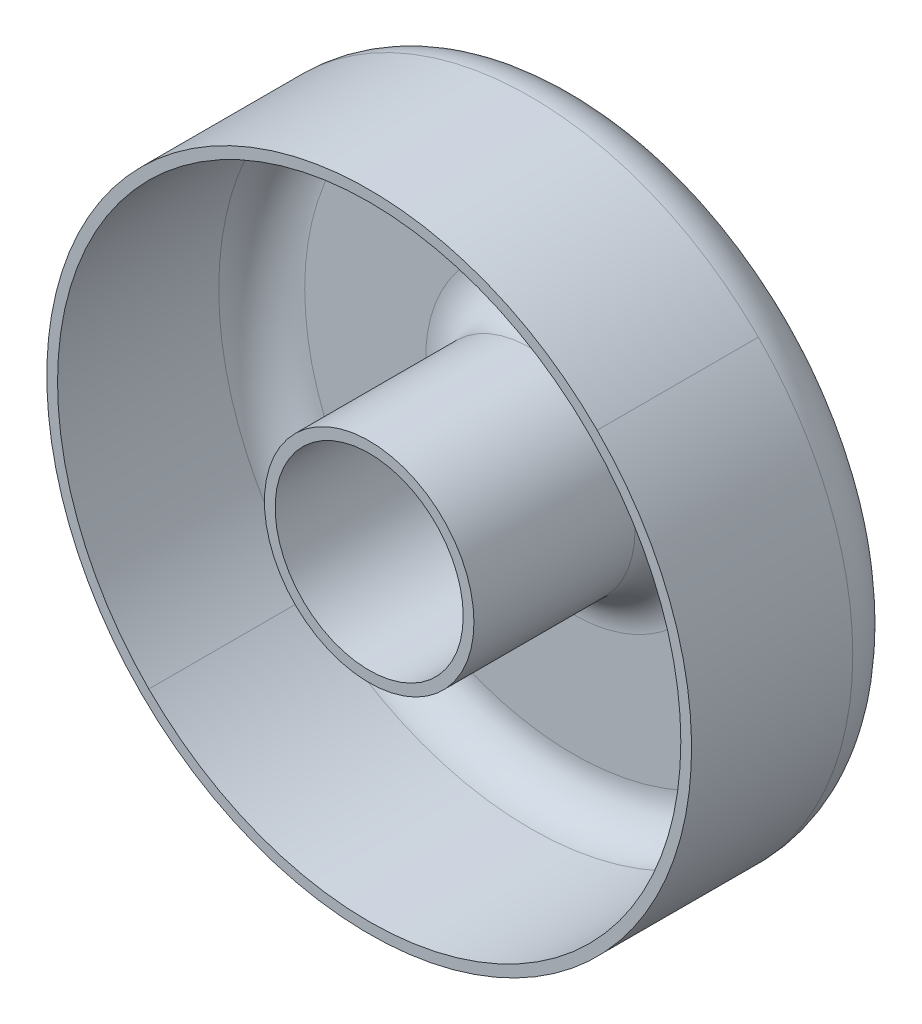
ISO-10303-21;
HEADER;
FILE_DESCRIPTION(('STEP AP214'),'2;1');
FILE_NAME('part.step','',(''),(''),'','','');
FILE_SCHEMA(('AUTOMOTIVE_DESIGN { 1 0 10303 214 1 1 1 1 }'));
ENDSEC;
DATA;
#1=APPLICATION_CONTEXT('core data for automotive mechanical design processes');
#2=APPLICATION_PROTOCOL_DEFINITION('international standard','automotive_design',2000,#1);
#3=PRODUCT_CONTEXT('',#1,'mechanical');
#4=PRODUCT('Part','Part','',(#3));
#5=PRODUCT_RELATED_PRODUCT_CATEGORY('part','',(#4));
#6=PRODUCT_DEFINITION_FORMATION('','',#4);
#7=PRODUCT_DEFINITION_CONTEXT('part definition',#1,'design');
#8=PRODUCT_DEFINITION('design','',#6,#7);
#9=PRODUCT_DEFINITION_SHAPE('','',#8);
#10=(LENGTH_UNIT() NAMED_UNIT(*) SI_UNIT(.MILLI.,.METRE.));
#11=(NAMED_UNIT(*) PLANE_ANGLE_UNIT() SI_UNIT($,.RADIAN.));
#12=(NAMED_UNIT(*) SI_UNIT($,.STERADIAN.) SOLID_ANGLE_UNIT());
#13=UNCERTAINTY_MEASURE_WITH_UNIT(LENGTH_MEASURE(1.E-05),#10,'distance_accuracy_value','');
#14=(GEOMETRIC_REPRESENTATION_CONTEXT(3) GLOBAL_UNCERTAINTY_ASSIGNED_CONTEXT((#13)) GLOBAL_UNIT_ASSIGNED_CONTEXT((#10,
#11,#12)) REPRESENTATION_CONTEXT('',''));
#15=CARTESIAN_POINT('',(0.,0.,0.));
#16=DIRECTION('',(0.,0.,1.));
#17=DIRECTION('',(1.,0.,0.));
#18=AXIS2_PLACEMENT_3D('',#15,#16,#17);
#19=CARTESIAN_POINT('',(0.,0.,40.));
#20=DIRECTION('',(0.,0.,-1.));
#21=DIRECTION('',(-1.,0.,0.));
#22=AXIS2_PLACEMENT_3D('',#19,#20,#21);
#23=CYLINDRICAL_SURFACE('',#22,58.);
#24=CARTESIAN_POINT('',(0.,0.,10.));
#25=DIRECTION('',(0.,0.,-1.));
#26=DIRECTION('',(-1.,0.,0.));
#27=AXIS2_PLACEMENT_3D('',#24,#25,#26);
#28=CIRCLE('',#27,58.);
#29=CARTESIAN_POINT('',(-41.0121933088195,41.01219330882,10.));
#30=VERTEX_POINT('',#29);
#31=CARTESIAN_POINT('',(-41.0121933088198,-41.0121933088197,10.));
#32=VERTEX_POINT('',#31);
#33=EDGE_CURVE('E162',#30,#32,#28,.F.);
#34=ORIENTED_EDGE('',*,*,#33,.F.);
#35=DIRECTION('',(0.,0.,-1.));
#36=VECTOR('',#35,1.);
#37=CARTESIAN_POINT('',(-41.0121933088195,41.01219330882,40.));
#38=LINE('',#37,#36);
#39=CARTESIAN_POINT('',(-41.0121933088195,41.01219330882,40.));
#40=VERTEX_POINT('',#39);
#41=EDGE_CURVE('E11',#30,#40,#38,.F.);
#42=ORIENTED_EDGE('',*,*,#41,.T.);
#43=CARTESIAN_POINT('',(0.,0.,40.));
#44=DIRECTION('',(0.,0.,1.));
#45=DIRECTION('',(1.,0.,0.));
#46=AXIS2_PLACEMENT_3D('',#43,#44,#45);
#47=CIRCLE('',#46,58.);
#48=CARTESIAN_POINT('',(-41.0121933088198,-41.0121933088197,40.));
#49=VERTEX_POINT('',#48);
#50=EDGE_CURVE('E146',#40,#49,#47,.T.);
#51=ORIENTED_EDGE('',*,*,#50,.T.);
#52=DIRECTION('',(0.,0.,-1.));
#53=VECTOR('',#52,1.);
#54=CARTESIAN_POINT('',(-41.0121933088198,-41.0121933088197,40.));
#55=LINE('',#54,#53);
#56=EDGE_CURVE('E110',#32,#49,#55,.F.);
#57=ORIENTED_EDGE('',*,*,#56,.F.);
#58=EDGE_LOOP('',(#34,#42,#51,#57));
#59=FACE_BOUND('',#58,.T.);
#60=ADVANCED_FACE('F44',(#59),#23,.F.);
#61=CARTESIAN_POINT('',(0.,0.,40.));
#62=DIRECTION('',(0.,0.,-1.));
#63=DIRECTION('',(-1.,0.,0.));
#64=AXIS2_PLACEMENT_3D('',#61,#62,#63);
#65=CYLINDRICAL_SURFACE('',#64,60.);
#66=DIRECTION('',(0.,0.,-1.));
#67=VECTOR('',#66,1.);
#68=CARTESIAN_POINT('',(-42.4264068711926,42.4264068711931,40.));
#69=LINE('',#68,#67);
#70=CARTESIAN_POINT('',(-42.4264068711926,42.4264068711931,10.));
#71=VERTEX_POINT('',#70);
#72=CARTESIAN_POINT('',(-42.4264068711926,42.4264068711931,40.));
#73=VERTEX_POINT('',#72);
#74=EDGE_CURVE('E47',#71,#73,#69,.F.);
#75=ORIENTED_EDGE('',*,*,#74,.F.);
#76=CARTESIAN_POINT('',(0.,0.,10.));
#77=DIRECTION('',(0.,0.,1.));
#78=DIRECTION('',(1.,0.,0.));
#79=AXIS2_PLACEMENT_3D('',#76,#77,#78);
#80=CIRCLE('',#79,60.);
#81=CARTESIAN_POINT('',(-42.4264068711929,-42.4264068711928,10.));
#82=VERTEX_POINT('',#81);
#83=EDGE_CURVE('E120',#71,#82,#80,.T.);
#84=ORIENTED_EDGE('',*,*,#83,.T.);
#85=DIRECTION('',(0.,0.,-1.));
#86=VECTOR('',#85,1.);
#87=CARTESIAN_POINT('',(-42.4264068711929,-42.4264068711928,40.));
#88=LINE('',#87,#86);
#89=CARTESIAN_POINT('',(-42.4264068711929,-42.4264068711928,40.));
#90=VERTEX_POINT('',#89);
#91=EDGE_CURVE('E108',#82,#90,#88,.F.);
#92=ORIENTED_EDGE('',*,*,#91,.T.);
#93=CARTESIAN_POINT('',(0.,0.,40.));
#94=DIRECTION('',(0.,0.,1.));
#95=DIRECTION('',(1.,0.,0.));
#96=AXIS2_PLACEMENT_3D('',#93,#94,#95);
#97=CIRCLE('',#96,60.);
#98=EDGE_CURVE('E177',#73,#90,#97,.T.);
#99=ORIENTED_EDGE('',*,*,#98,.F.);
#100=EDGE_LOOP('',(#75,#84,#92,#99));
#101=FACE_BOUND('',#100,.T.);
#102=ADVANCED_FACE('F201',(#101),#65,.T.);
#103=CARTESIAN_POINT('',(41.0121933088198,41.0121933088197,40.));
#104=VERTEX_POINT('',#103);
#105=EDGE_CURVE('E139',#49,#104,#47,.T.);
#106=ORIENTED_EDGE('',*,*,#105,.T.);
#107=DIRECTION('',(0.,0.,-1.));
#108=VECTOR('',#107,1.);
#109=CARTESIAN_POINT('',(41.0121933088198,41.0121933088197,40.));
#110=LINE('',#109,#108);
#111=CARTESIAN_POINT('',(41.0121933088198,41.0121933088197,10.));
#112=VERTEX_POINT('',#111);
#113=EDGE_CURVE('E123',#104,#112,#110,.T.);
#114=ORIENTED_EDGE('',*,*,#113,.T.);
#115=EDGE_CURVE('E145',#32,#112,#28,.F.);
#116=ORIENTED_EDGE('',*,*,#115,.F.);
#117=ORIENTED_EDGE('',*,*,#56,.T.);
#118=EDGE_LOOP('',(#106,#114,#116,#117));
#119=FACE_BOUND('',#118,.T.);
#120=ADVANCED_FACE('F136',(#119),#23,.F.);
#121=DIRECTION('',(0.,0.,-1.));
#122=VECTOR('',#121,1.);
#123=CARTESIAN_POINT('',(42.4264068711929,42.4264068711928,40.));
#124=LINE('',#123,#122);
#125=CARTESIAN_POINT('',(42.4264068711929,42.4264068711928,40.));
#126=VERTEX_POINT('',#125);
#127=CARTESIAN_POINT('',(42.4264068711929,42.4264068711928,10.));
#128=VERTEX_POINT('',#127);
#129=EDGE_CURVE('E98',#126,#128,#124,.T.);
#130=ORIENTED_EDGE('',*,*,#129,.F.);
#131=EDGE_CURVE('E175',#90,#126,#97,.T.);
#132=ORIENTED_EDGE('',*,*,#131,.F.);
#133=ORIENTED_EDGE('',*,*,#91,.F.);
#134=EDGE_CURVE('E115',#82,#128,#80,.T.);
#135=ORIENTED_EDGE('',*,*,#134,.T.);
#136=EDGE_LOOP('',(#130,#132,#133,#135));
#137=FACE_BOUND('',#136,.T.);
#138=ADVANCED_FACE('F112',(#137),#65,.T.);
#139=CARTESIAN_POINT('',(0.,0.,40.));
#140=DIRECTION('',(0.,0.,1.));
#141=DIRECTION('',(1.,0.,0.));
#142=AXIS2_PLACEMENT_3D('',#139,#140,#141);
#143=PLANE('',#142);
#144=CARTESIAN_POINT('',(0.,0.,40.));
#145=DIRECTION('',(0.,0.,1.));
#146=DIRECTION('',(1.,0.,0.));
#147=AXIS2_PLACEMENT_3D('',#144,#145,#146);
#148=CIRCLE('',#147,17.5);
#149=CARTESIAN_POINT('',(17.5,0.,40.));
#150=VERTEX_POINT('',#149);
#151=EDGE_CURVE('E169',#150,#150,#148,.T.);
#152=ORIENTED_EDGE('',*,*,#151,.F.);
#153=EDGE_LOOP('',(#152));
#154=FACE_BOUND('',#153,.T.);
#155=CARTESIAN_POINT('',(0.,0.,40.));
#156=DIRECTION('',(0.,0.,1.));
#157=DIRECTION('',(1.,0.,0.));
#158=AXIS2_PLACEMENT_3D('',#155,#156,#157);
#159=CIRCLE('',#158,19.5);
#160=CARTESIAN_POINT('',(19.5,0.,40.));
#161=VERTEX_POINT('',#160);
#162=EDGE_CURVE('E149',#161,#161,#159,.T.);
#163=ORIENTED_EDGE('',*,*,#162,.T.);
#164=EDGE_LOOP('',(#163));
#165=FACE_BOUND('',#164,.T.);
#166=ADVANCED_FACE('F239',(#154,#165),#143,.T.);
#167=EDGE_CURVE('E97',#128,#71,#80,.T.);
#168=ORIENTED_EDGE('',*,*,#167,.T.);
#169=ORIENTED_EDGE('',*,*,#74,.T.);
#170=EDGE_CURVE('E105',#126,#73,#97,.T.);
#171=ORIENTED_EDGE('',*,*,#170,.F.);
#172=ORIENTED_EDGE('',*,*,#129,.T.);
#173=EDGE_LOOP('',(#168,#169,#171,#172));
#174=FACE_BOUND('',#173,.T.);
#175=ADVANCED_FACE('F96',(#174),#65,.T.);
#176=EDGE_CURVE('E147',#104,#40,#47,.T.);
#177=ORIENTED_EDGE('',*,*,#176,.F.);
#178=ORIENTED_EDGE('',*,*,#105,.F.);
#179=ORIENTED_EDGE('',*,*,#50,.F.);
#180=EDGE_LOOP('',(#177,#178,#179));
#181=FACE_BOUND('',#180,.T.);
#182=ORIENTED_EDGE('',*,*,#170,.T.);
#183=ORIENTED_EDGE('',*,*,#98,.T.);
#184=ORIENTED_EDGE('',*,*,#131,.T.);
#185=EDGE_LOOP('',(#182,#183,#184));
#186=FACE_BOUND('',#185,.T.);
#187=ADVANCED_FACE('F144',(#181,#186),#143,.T.);
#188=CARTESIAN_POINT('',(0.,0.,0.));
#189=DIRECTION('',(0.,0.,1.));
#190=DIRECTION('',(1.,0.,0.));
#191=AXIS2_PLACEMENT_3D('',#188,#189,#190);
#192=PLANE('',#191);
#193=CARTESIAN_POINT('',(0.,0.,0.));
#194=DIRECTION('',(0.,0.,1.));
#195=DIRECTION('',(1.,0.,0.));
#196=AXIS2_PLACEMENT_3D('',#193,#194,#195);
#197=CIRCLE('',#196,27.5);
#198=CARTESIAN_POINT('',(27.5,0.,0.));
#199=VERTEX_POINT('',#198);
#200=EDGE_CURVE('E182',#199,#199,#197,.T.);
#201=ORIENTED_EDGE('',*,*,#200,.T.);
#202=EDGE_LOOP('',(#201));
#203=FACE_BOUND('',#202,.T.);
#204=CARTESIAN_POINT('',(0.,0.,0.));
#205=DIRECTION('',(0.,0.,1.));
#206=DIRECTION('',(1.,0.,0.));
#207=AXIS2_PLACEMENT_3D('',#204,#205,#206);
#208=CIRCLE('',#207,50.);
#209=CARTESIAN_POINT('',(50.,0.,0.));
#210=VERTEX_POINT('',#209);
#211=EDGE_CURVE('E176',#210,#210,#208,.F.);
#212=ORIENTED_EDGE('',*,*,#211,.T.);
#213=EDGE_LOOP('',(#212));
#214=FACE_BOUND('',#213,.T.);
#215=ADVANCED_FACE('F202',(#203,#214),#192,.F.);
#216=CARTESIAN_POINT('',(0.,0.,0.));
#217=DIRECTION('',(0.,0.,1.));
#218=DIRECTION('',(1.,0.,0.));
#219=AXIS2_PLACEMENT_3D('',#216,#217,#218);
#220=CYLINDRICAL_SURFACE('',#219,17.5);
#221=CARTESIAN_POINT('',(0.,0.,10.));
#222=DIRECTION('',(0.,0.,1.));
#223=DIRECTION('',(1.,0.,0.));
#224=AXIS2_PLACEMENT_3D('',#221,#222,#223);
#225=CIRCLE('',#224,17.5);
#226=CARTESIAN_POINT('',(17.5,0.,10.));
#227=VERTEX_POINT('',#226);
#228=EDGE_CURVE('E119',#227,#227,#225,.F.);
#229=ORIENTED_EDGE('',*,*,#228,.T.);
#230=EDGE_LOOP('',(#229));
#231=FACE_BOUND('',#230,.T.);
#232=ORIENTED_EDGE('',*,*,#151,.T.);
#233=EDGE_LOOP('',(#232));
#234=FACE_BOUND('',#233,.T.);
#235=ADVANCED_FACE('F188',(#231,#234),#220,.F.);
#236=CARTESIAN_POINT('',(0.,0.,10.));
#237=DIRECTION('',(0.,0.,1.));
#238=DIRECTION('',(1.,0.,0.));
#239=AXIS2_PLACEMENT_3D('',#236,#237,#238);
#240=TOROIDAL_SURFACE('',#239,27.5,10.);
#241=ORIENTED_EDGE('',*,*,#228,.F.);
#242=EDGE_LOOP('',(#241));
#243=FACE_BOUND('',#242,.T.);
#244=ORIENTED_EDGE('',*,*,#200,.F.);
#245=EDGE_LOOP('',(#244));
#246=FACE_BOUND('',#245,.T.);
#247=ADVANCED_FACE('F189',(#243,#246),#240,.T.);
#248=CARTESIAN_POINT('',(0.,0.,10.));
#249=DIRECTION('',(0.,0.,1.));
#250=DIRECTION('',(1.,0.,0.));
#251=AXIS2_PLACEMENT_3D('',#248,#249,#250);
#252=TOROIDAL_SURFACE('',#251,50.,10.);
#253=ORIENTED_EDGE('',*,*,#211,.F.);
#254=EDGE_LOOP('',(#253));
#255=FACE_BOUND('',#254,.T.);
#256=ORIENTED_EDGE('',*,*,#167,.F.);
#257=ORIENTED_EDGE('',*,*,#134,.F.);
#258=ORIENTED_EDGE('',*,*,#83,.F.);
#259=EDGE_LOOP('',(#256,#257,#258));
#260=FACE_BOUND('',#259,.T.);
#261=ADVANCED_FACE('F50',(#255,#260),#252,.T.);
#262=ORIENTED_EDGE('',*,*,#41,.F.);
#263=EDGE_CURVE('E170',#112,#30,#28,.F.);
#264=ORIENTED_EDGE('',*,*,#263,.F.);
#265=ORIENTED_EDGE('',*,*,#113,.F.);
#266=ORIENTED_EDGE('',*,*,#176,.T.);
#267=EDGE_LOOP('',(#262,#264,#265,#266));
#268=FACE_BOUND('',#267,.T.);
#269=ADVANCED_FACE('F196',(#268),#23,.F.);
#270=CARTESIAN_POINT('',(0.,0.,2.));
#271=DIRECTION('',(0.,0.,1.));
#272=DIRECTION('',(1.,0.,0.));
#273=AXIS2_PLACEMENT_3D('',#270,#271,#272);
#274=PLANE('',#273);
#275=CARTESIAN_POINT('',(0.,0.,2.));
#276=DIRECTION('',(0.,0.,1.));
#277=DIRECTION('',(1.,0.,0.));
#278=AXIS2_PLACEMENT_3D('',#275,#276,#277);
#279=CIRCLE('',#278,27.5);
#280=CARTESIAN_POINT('',(27.5,0.,2.));
#281=VERTEX_POINT('',#280);
#282=EDGE_CURVE('E154',#281,#281,#279,.T.);
#283=ORIENTED_EDGE('',*,*,#282,.F.);
#284=EDGE_LOOP('',(#283));
#285=FACE_BOUND('',#284,.T.);
#286=CARTESIAN_POINT('',(0.,0.,2.));
#287=DIRECTION('',(0.,0.,1.));
#288=DIRECTION('',(1.,0.,0.));
#289=AXIS2_PLACEMENT_3D('',#286,#287,#288);
#290=CIRCLE('',#289,50.);
#291=CARTESIAN_POINT('',(50.,0.,2.));
#292=VERTEX_POINT('',#291);
#293=EDGE_CURVE('E151',#292,#292,#290,.F.);
#294=ORIENTED_EDGE('',*,*,#293,.F.);
#295=EDGE_LOOP('',(#294));
#296=FACE_BOUND('',#295,.T.);
#297=ADVANCED_FACE('F218',(#285,#296),#274,.T.);
#298=CARTESIAN_POINT('',(0.,0.,0.));
#299=DIRECTION('',(0.,0.,1.));
#300=DIRECTION('',(1.,0.,0.));
#301=AXIS2_PLACEMENT_3D('',#298,#299,#300);
#302=CYLINDRICAL_SURFACE('',#301,19.5);
#303=CARTESIAN_POINT('',(0.,0.,10.));
#304=DIRECTION('',(0.,0.,1.));
#305=DIRECTION('',(1.,0.,0.));
#306=AXIS2_PLACEMENT_3D('',#303,#304,#305);
#307=CIRCLE('',#306,19.5);
#308=CARTESIAN_POINT('',(19.5,0.,10.));
#309=VERTEX_POINT('',#308);
#310=EDGE_CURVE('E157',#309,#309,#307,.F.);
#311=ORIENTED_EDGE('',*,*,#310,.F.);
#312=EDGE_LOOP('',(#311));
#313=FACE_BOUND('',#312,.T.);
#314=ORIENTED_EDGE('',*,*,#162,.F.);
#315=EDGE_LOOP('',(#314));
#316=FACE_BOUND('',#315,.T.);
#317=ADVANCED_FACE('F221',(#313,#316),#302,.T.);
#318=CARTESIAN_POINT('',(0.,0.,10.));
#319=DIRECTION('',(0.,0.,1.));
#320=DIRECTION('',(1.,0.,0.));
#321=AXIS2_PLACEMENT_3D('',#318,#319,#320);
#322=TOROIDAL_SURFACE('',#321,27.5,8.);
#323=ORIENTED_EDGE('',*,*,#310,.T.);
#324=EDGE_LOOP('',(#323));
#325=FACE_BOUND('',#324,.T.);
#326=ORIENTED_EDGE('',*,*,#282,.T.);
#327=EDGE_LOOP('',(#326));
#328=FACE_BOUND('',#327,.T.);
#329=ADVANCED_FACE('F230',(#325,#328),#322,.F.);
#330=CARTESIAN_POINT('',(0.,0.,10.));
#331=DIRECTION('',(0.,0.,1.));
#332=DIRECTION('',(1.,0.,0.));
#333=AXIS2_PLACEMENT_3D('',#330,#331,#332);
#334=TOROIDAL_SURFACE('',#333,50.,8.);
#335=ORIENTED_EDGE('',*,*,#293,.T.);
#336=EDGE_LOOP('',(#335));
#337=FACE_BOUND('',#336,.T.);
#338=ORIENTED_EDGE('',*,*,#115,.T.);
#339=ORIENTED_EDGE('',*,*,#263,.T.);
#340=ORIENTED_EDGE('',*,*,#33,.T.);
#341=EDGE_LOOP('',(#338,#339,#340));
#342=FACE_BOUND('',#341,.T.);
#343=ADVANCED_FACE('F233',(#337,#342),#334,.F.);
#344=CLOSED_SHELL('',(#60,#102,#120,#138,#166,#175,#187,#215,#235,#247,#261,#269,#297,#317,#329,#343));
#345=MANIFOLD_SOLID_BREP('B2',#344);
#346=ADVANCED_BREP_SHAPE_REPRESENTATION('',(#18,#345),#14);
#347=SHAPE_DEFINITION_REPRESENTATION(#9,#346);
ENDSEC;
END-ISO-10303-21;
